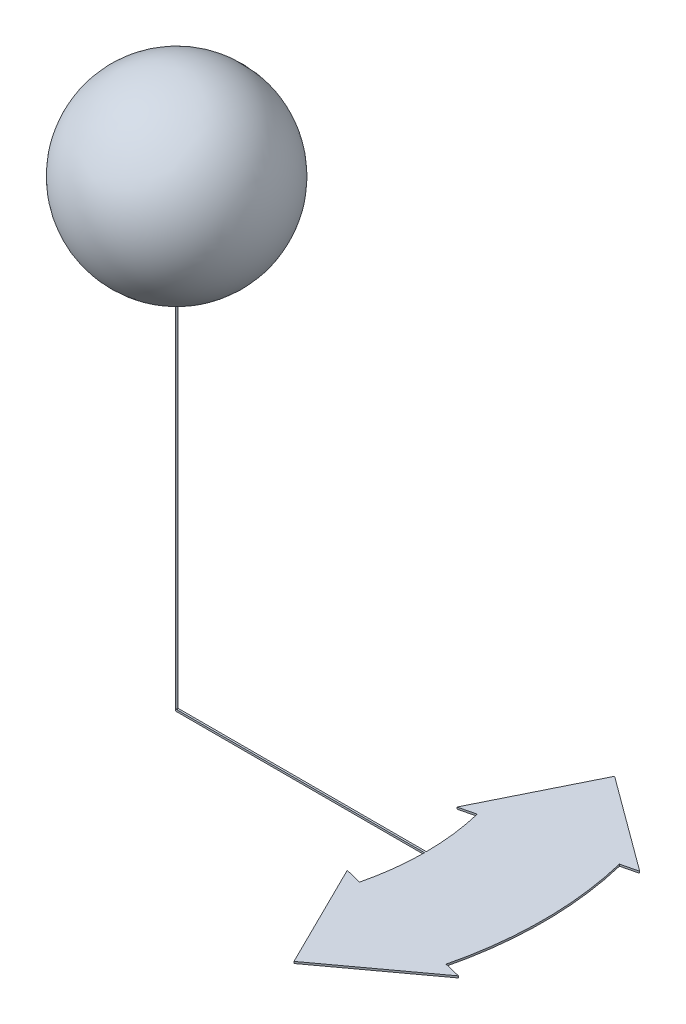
ISO-10303-21;
HEADER;
FILE_DESCRIPTION(('STEP AP214'),'2;1');
FILE_NAME('part.step','',(''),(''),'','','');
FILE_SCHEMA(('AUTOMOTIVE_DESIGN { 1 0 10303 214 1 1 1 1 }'));
ENDSEC;
DATA;
#1=APPLICATION_CONTEXT('core data for automotive mechanical design processes');
#2=APPLICATION_PROTOCOL_DEFINITION('international standard','automotive_design',2000,#1);
#3=PRODUCT_CONTEXT('',#1,'mechanical');
#4=PRODUCT('Part','Part','',(#3));
#5=PRODUCT_RELATED_PRODUCT_CATEGORY('part','',(#4));
#6=PRODUCT_DEFINITION_FORMATION('','',#4);
#7=PRODUCT_DEFINITION_CONTEXT('part definition',#1,'design');
#8=PRODUCT_DEFINITION('design','',#6,#7);
#9=PRODUCT_DEFINITION_SHAPE('','',#8);
#10=(LENGTH_UNIT() NAMED_UNIT(*) SI_UNIT(.MILLI.,.METRE.));
#11=(NAMED_UNIT(*) PLANE_ANGLE_UNIT() SI_UNIT($,.RADIAN.));
#12=(NAMED_UNIT(*) SI_UNIT($,.STERADIAN.) SOLID_ANGLE_UNIT());
#13=UNCERTAINTY_MEASURE_WITH_UNIT(LENGTH_MEASURE(1.E-05),#10,'distance_accuracy_value','');
#14=(GEOMETRIC_REPRESENTATION_CONTEXT(3) GLOBAL_UNCERTAINTY_ASSIGNED_CONTEXT((#13)) GLOBAL_UNIT_ASSIGNED_CONTEXT((#10,
#11,#12)) REPRESENTATION_CONTEXT('',''));
#15=CARTESIAN_POINT('',(0.,0.,0.));
#16=DIRECTION('',(0.,0.,1.));
#17=DIRECTION('',(1.,0.,0.));
#18=AXIS2_PLACEMENT_3D('',#15,#16,#17);
#19=CARTESIAN_POINT('',(0.,0.,0.));
#20=DIRECTION('',(1.,0.,0.));
#21=DIRECTION('',(0.,-1.,0.));
#22=AXIS2_PLACEMENT_3D('',#19,#20,#21);
#23=SPHERICAL_SURFACE('',#22,5.);
#24=CARTESIAN_POINT('',(0.,-4.00000000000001,0.));
#25=DIRECTION('',(0.,1.,0.));
#26=DIRECTION('',(0.,0.,1.));
#27=AXIS2_PLACEMENT_3D('',#24,#25,#26);
#28=CIRCLE('',#27,3.);
#29=CARTESIAN_POINT('',(0.,-4.00000000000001,3.00000000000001));
#30=VERTEX_POINT('',#29);
#31=EDGE_CURVE('E263',#30,#30,#28,.T.);
#32=ORIENTED_EDGE('',*,*,#31,.T.);
#33=EDGE_LOOP('',(#32));
#34=FACE_BOUND('',#33,.T.);
#35=CARTESIAN_POINT('',(0.,0.,-4.));
#36=DIRECTION('',(0.,0.,1.));
#37=DIRECTION('',(1.,0.,0.));
#38=AXIS2_PLACEMENT_3D('',#35,#36,#37);
#39=CIRCLE('',#38,3.);
#40=CARTESIAN_POINT('',(3.00000000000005,0.,-4.));
#41=VERTEX_POINT('',#40);
#42=EDGE_CURVE('E269',#41,#41,#39,.T.);
#43=ORIENTED_EDGE('',*,*,#42,.T.);
#44=EDGE_LOOP('',(#43));
#45=FACE_BOUND('',#44,.T.);
#46=ADVANCED_FACE('F32',(#34,#45),#23,.T.);
#47=CARTESIAN_POINT('',(0.,0.,-5.));
#48=DIRECTION('',(0.,0.,1.));
#49=DIRECTION('',(1.,0.,0.));
#50=AXIS2_PLACEMENT_3D('',#47,#48,#49);
#51=CYLINDRICAL_SURFACE('',#50,3.);
#52=CARTESIAN_POINT('',(0.,0.,0.));
#53=DIRECTION('',(0.,0.,1.));
#54=DIRECTION('',(1.,0.,0.));
#55=AXIS2_PLACEMENT_3D('',#52,#53,#54);
#56=CIRCLE('',#55,3.);
#57=CARTESIAN_POINT('',(3.00000000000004,0.,0.));
#58=VERTEX_POINT('',#57);
#59=CARTESIAN_POINT('',(-2.99999999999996,0.,0.));
#60=VERTEX_POINT('',#59);
#61=EDGE_CURVE('E266',#58,#60,#56,.T.);
#62=ORIENTED_EDGE('',*,*,#61,.T.);
#63=CARTESIAN_POINT('',(0.,0.,0.));
#64=DIRECTION('',(0.,-0.707106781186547,0.70710678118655));
#65=DIRECTION('',(0.,0.707106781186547,0.70710678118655));
#66=AXIS2_PLACEMENT_3D('',#63,#64,#65);
#67=ELLIPSE('',#66,4.24264068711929,3.);
#68=EDGE_CURVE('E260',#60,#58,#67,.T.);
#69=ORIENTED_EDGE('',*,*,#68,.T.);
#70=EDGE_LOOP('',(#62,#69));
#71=FACE_BOUND('',#70,.T.);
#72=ORIENTED_EDGE('',*,*,#42,.F.);
#73=EDGE_LOOP('',(#72));
#74=FACE_BOUND('',#73,.T.);
#75=ADVANCED_FACE('F287',(#71,#74),#51,.F.);
#76=CARTESIAN_POINT('',(0.,0.,0.));
#77=DIRECTION('',(0.,0.,1.));
#78=DIRECTION('',(1.,0.,0.));
#79=AXIS2_PLACEMENT_3D('',#76,#77,#78);
#80=PLANE('',#79);
#81=ORIENTED_EDGE('',*,*,#61,.F.);
#82=DIRECTION('',(-1.,0.,0.));
#83=VECTOR('',#82,1.);
#84=CARTESIAN_POINT('',(0.,0.,0.));
#85=LINE('',#84,#83);
#86=CARTESIAN_POINT('',(0.0499999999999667,0.,0.));
#87=VERTEX_POINT('',#86);
#88=EDGE_CURVE('E39',#58,#87,#85,.T.);
#89=ORIENTED_EDGE('',*,*,#88,.T.);
#90=CARTESIAN_POINT('',(-0.05000000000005,0.,0.));
#91=VERTEX_POINT('',#90);
#92=EDGE_CURVE('E273',#87,#91,#85,.T.);
#93=ORIENTED_EDGE('',*,*,#92,.T.);
#94=EDGE_CURVE('E271',#91,#60,#85,.T.);
#95=ORIENTED_EDGE('',*,*,#94,.T.);
#96=EDGE_LOOP('',(#81,#89,#93,#95));
#97=FACE_BOUND('',#96,.T.);
#98=ADVANCED_FACE('F279',(#97),#80,.F.);
#99=CARTESIAN_POINT('',(0.,-5.,0.));
#100=DIRECTION('',(0.,1.,0.));
#101=DIRECTION('',(0.,0.,1.));
#102=AXIS2_PLACEMENT_3D('',#99,#100,#101);
#103=CYLINDRICAL_SURFACE('',#102,3.);
#104=CARTESIAN_POINT('',(0.,0.,0.));
#105=DIRECTION('',(0.,1.,0.));
#106=DIRECTION('',(0.,0.,1.));
#107=AXIS2_PLACEMENT_3D('',#104,#105,#106);
#108=CIRCLE('',#107,3.);
#109=EDGE_CURVE('E257',#60,#58,#108,.T.);
#110=ORIENTED_EDGE('',*,*,#109,.T.);
#111=ORIENTED_EDGE('',*,*,#68,.F.);
#112=EDGE_LOOP('',(#110,#111));
#113=FACE_BOUND('',#112,.T.);
#114=ORIENTED_EDGE('',*,*,#31,.F.);
#115=EDGE_LOOP('',(#114));
#116=FACE_BOUND('',#115,.T.);
#117=ADVANCED_FACE('F284',(#113,#116),#103,.F.);
#118=CARTESIAN_POINT('',(0.,0.,0.));
#119=DIRECTION('',(0.,1.,0.));
#120=DIRECTION('',(0.,0.,1.));
#121=AXIS2_PLACEMENT_3D('',#118,#119,#120);
#122=PLANE('',#121);
#123=ORIENTED_EDGE('',*,*,#94,.F.);
#124=CARTESIAN_POINT('',(0.,0.,0.));
#125=DIRECTION('',(0.,1.,0.));
#126=DIRECTION('',(0.,0.,1.));
#127=AXIS2_PLACEMENT_3D('',#124,#125,#126);
#128=CIRCLE('',#127,0.05);
#129=EDGE_CURVE('E11',#91,#87,#128,.T.);
#130=ORIENTED_EDGE('',*,*,#129,.T.);
#131=ORIENTED_EDGE('',*,*,#88,.F.);
#132=ORIENTED_EDGE('',*,*,#109,.F.);
#133=EDGE_LOOP('',(#123,#130,#131,#132));
#134=FACE_BOUND('',#133,.T.);
#135=ADVANCED_FACE('F282',(#134),#122,.F.);
#136=CARTESIAN_POINT('',(0.,0.,0.));
#137=DIRECTION('',(0.,1.,0.));
#138=DIRECTION('',(0.,0.,1.));
#139=AXIS2_PLACEMENT_3D('',#136,#137,#138);
#140=PLANE('',#139);
#141=ORIENTED_EDGE('',*,*,#92,.F.);
#142=CARTESIAN_POINT('',(0.,0.,0.));
#143=DIRECTION('',(0.,1.,0.));
#144=DIRECTION('',(0.,0.,1.));
#145=AXIS2_PLACEMENT_3D('',#142,#143,#144);
#146=CIRCLE('',#145,0.05);
#147=EDGE_CURVE('E53',#87,#91,#146,.T.);
#148=ORIENTED_EDGE('',*,*,#147,.T.);
#149=EDGE_LOOP('',(#141,#148));
#150=FACE_BOUND('',#149,.T.);
#151=ADVANCED_FACE('F303',(#150),#140,.T.);
#152=CARTESIAN_POINT('',(0.,-25.,0.));
#153=DIRECTION('',(0.,1.,0.));
#154=DIRECTION('',(0.,0.,1.));
#155=AXIS2_PLACEMENT_3D('',#152,#153,#154);
#156=CYLINDRICAL_SURFACE('',#155,0.05);
#157=CARTESIAN_POINT('',(0.,-25.,0.));
#158=DIRECTION('',(0.,1.,0.));
#159=DIRECTION('',(0.,0.,1.));
#160=AXIS2_PLACEMENT_3D('',#157,#158,#159);
#161=CIRCLE('',#160,0.05);
#162=CARTESIAN_POINT('',(0.,-25.,0.0500000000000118));
#163=VERTEX_POINT('',#162);
#164=CARTESIAN_POINT('',(0.,-25.0000000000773,-0.0499999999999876));
#165=VERTEX_POINT('',#164);
#166=EDGE_CURVE('E255',#163,#165,#161,.T.);
#167=ORIENTED_EDGE('',*,*,#166,.T.);
#168=DIRECTION('',(0.,1.,0.));
#169=VECTOR('',#168,1.);
#170=CARTESIAN_POINT('',(0.,-25.1000000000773,-0.049999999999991));
#171=LINE('',#170,#169);
#172=CARTESIAN_POINT('',(0.,-25.1000000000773,-0.049999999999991));
#173=VERTEX_POINT('',#172);
#174=EDGE_CURVE('E247',#173,#165,#171,.T.);
#175=ORIENTED_EDGE('',*,*,#174,.F.);
#176=CARTESIAN_POINT('',(0.,-25.1000000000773,0.));
#177=DIRECTION('',(0.,-1.,0.));
#178=DIRECTION('',(0.,0.,-1.));
#179=AXIS2_PLACEMENT_3D('',#176,#177,#178);
#180=CIRCLE('',#179,0.0499999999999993);
#181=CARTESIAN_POINT('',(0.,-25.1000000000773,0.0500000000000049));
#182=VERTEX_POINT('',#181);
#183=EDGE_CURVE('E202',#182,#173,#180,.T.);
#184=ORIENTED_EDGE('',*,*,#183,.F.);
#185=DIRECTION('',(0.,1.,0.));
#186=VECTOR('',#185,1.);
#187=CARTESIAN_POINT('',(0.,-25.1000000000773,0.0500000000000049));
#188=LINE('',#187,#186);
#189=EDGE_CURVE('E46',#182,#163,#188,.T.);
#190=ORIENTED_EDGE('',*,*,#189,.T.);
#191=EDGE_LOOP('',(#167,#175,#184,#190));
#192=FACE_BOUND('',#191,.T.);
#193=ORIENTED_EDGE('',*,*,#147,.F.);
#194=ORIENTED_EDGE('',*,*,#129,.F.);
#195=EDGE_LOOP('',(#193,#194));
#196=FACE_BOUND('',#195,.T.);
#197=ADVANCED_FACE('F307',(#192,#196),#156,.T.);
#198=CARTESIAN_POINT('',(12.2318840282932,-25.1000000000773,2.97580678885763));
#199=DIRECTION('',(0.896280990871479,0.,-0.443486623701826));
#200=DIRECTION('',(-0.443486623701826,0.,-0.89628099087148));
#201=AXIS2_PLACEMENT_3D('',#198,#199,#200);
#202=PLANE('',#201);
#203=DIRECTION('',(-0.443486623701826,0.,-0.89628099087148));
#204=VECTOR('',#203,1.);
#205=CARTESIAN_POINT('',(12.2318840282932,-25.0000000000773,2.97580678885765));
#206=LINE('',#205,#204);
#207=CARTESIAN_POINT('',(15.062424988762,-25.0000000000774,8.69629512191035));
#208=VERTEX_POINT('',#207);
#209=CARTESIAN_POINT('',(12.2318840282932,-25.0000000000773,2.97580678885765));
#210=VERTEX_POINT('',#209);
#211=EDGE_CURVE('E152',#208,#210,#206,.T.);
#212=ORIENTED_EDGE('',*,*,#211,.T.);
#213=DIRECTION('',(0.,1.,0.));
#214=VECTOR('',#213,1.);
#215=CARTESIAN_POINT('',(12.2318840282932,-25.1000000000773,2.97580678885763));
#216=LINE('',#215,#214);
#217=CARTESIAN_POINT('',(12.2318840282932,-25.1000000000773,2.97580678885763));
#218=VERTEX_POINT('',#217);
#219=EDGE_CURVE('E160',#218,#210,#216,.T.);
#220=ORIENTED_EDGE('',*,*,#219,.F.);
#221=DIRECTION('',(-0.443486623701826,0.,-0.89628099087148));
#222=VECTOR('',#221,1.);
#223=CARTESIAN_POINT('',(12.2318840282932,-25.1000000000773,2.97580678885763));
#224=LINE('',#223,#222);
#225=CARTESIAN_POINT('',(15.062424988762,-25.1000000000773,8.69629512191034));
#226=VERTEX_POINT('',#225);
#227=EDGE_CURVE('E195',#226,#218,#224,.T.);
#228=ORIENTED_EDGE('',*,*,#227,.F.);
#229=DIRECTION('',(0.,1.,0.));
#230=VECTOR('',#229,1.);
#231=CARTESIAN_POINT('',(15.062424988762,-25.1000000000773,8.69629512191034));
#232=LINE('',#231,#230);
#233=EDGE_CURVE('E171',#226,#208,#232,.T.);
#234=ORIENTED_EDGE('',*,*,#233,.T.);
#235=EDGE_LOOP('',(#212,#220,#228,#234));
#236=FACE_BOUND('',#235,.T.);
#237=ADVANCED_FACE('F169',(#236),#202,.F.);
#238=CARTESIAN_POINT('',(13.1173935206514,-25.1000000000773,3.1912360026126));
#239=DIRECTION('',(-0.236387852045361,0.,0.971658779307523));
#240=DIRECTION('',(0.971658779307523,0.,0.236387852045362));
#241=AXIS2_PLACEMENT_3D('',#238,#239,#240);
#242=PLANE('',#241);
#243=DIRECTION('',(0.971658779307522,0.,0.236387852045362));
#244=VECTOR('',#243,1.);
#245=CARTESIAN_POINT('',(13.1173935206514,-25.0000000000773,3.19123600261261));
#246=LINE('',#245,#244);
#247=CARTESIAN_POINT('',(13.1173935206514,-25.0000000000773,3.19123600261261));
#248=VERTEX_POINT('',#247);
#249=EDGE_CURVE('E146',#210,#248,#246,.T.);
#250=ORIENTED_EDGE('',*,*,#249,.T.);
#251=DIRECTION('',(0.,1.,0.));
#252=VECTOR('',#251,1.);
#253=CARTESIAN_POINT('',(13.1173935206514,-25.1000000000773,3.1912360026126));
#254=LINE('',#253,#252);
#255=CARTESIAN_POINT('',(13.1173935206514,-25.1000000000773,3.1912360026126));
#256=VERTEX_POINT('',#255);
#257=EDGE_CURVE('E166',#256,#248,#254,.T.);
#258=ORIENTED_EDGE('',*,*,#257,.F.);
#259=DIRECTION('',(0.971658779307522,0.,0.236387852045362));
#260=VECTOR('',#259,1.);
#261=CARTESIAN_POINT('',(13.1173935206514,-25.1000000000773,3.1912360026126));
#262=LINE('',#261,#260);
#263=EDGE_CURVE('E162',#218,#256,#262,.T.);
#264=ORIENTED_EDGE('',*,*,#263,.F.);
#265=ORIENTED_EDGE('',*,*,#219,.T.);
#266=EDGE_LOOP('',(#250,#258,#264,#265));
#267=FACE_BOUND('',#266,.T.);
#268=ADVANCED_FACE('F161',(#267),#242,.F.);
#269=CARTESIAN_POINT('',(0.,-25.1000000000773,0.));
#270=DIRECTION('',(0.,1.,0.));
#271=DIRECTION('',(0.,0.,1.));
#272=AXIS2_PLACEMENT_3D('',#269,#270,#271);
#273=CYLINDRICAL_SURFACE('',#272,13.5);
#274=CARTESIAN_POINT('',(0.,-25.0000000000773,0.));
#275=DIRECTION('',(0.,1.,0.));
#276=DIRECTION('',(0.,0.,-1.));
#277=AXIS2_PLACEMENT_3D('',#274,#275,#276);
#278=CIRCLE('',#277,13.5);
#279=CARTESIAN_POINT('',(13.4999074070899,-25.0000000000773,0.0500000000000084));
#280=VERTEX_POINT('',#279);
#281=EDGE_CURVE('E154',#248,#280,#278,.T.);
#282=ORIENTED_EDGE('',*,*,#281,.T.);
#283=DIRECTION('',(0.,1.,0.));
#284=VECTOR('',#283,1.);
#285=CARTESIAN_POINT('',(13.4999074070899,-25.1000000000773,0.0500000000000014));
#286=LINE('',#285,#284);
#287=CARTESIAN_POINT('',(13.4999074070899,-25.1000000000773,0.0500000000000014));
#288=VERTEX_POINT('',#287);
#289=EDGE_CURVE('E250',#288,#280,#286,.T.);
#290=ORIENTED_EDGE('',*,*,#289,.F.);
#291=CARTESIAN_POINT('',(0.,-25.1000000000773,0.));
#292=DIRECTION('',(0.,1.,0.));
#293=DIRECTION('',(0.,0.,-1.));
#294=AXIS2_PLACEMENT_3D('',#291,#292,#293);
#295=CIRCLE('',#294,13.5);
#296=EDGE_CURVE('E198',#256,#288,#295,.T.);
#297=ORIENTED_EDGE('',*,*,#296,.F.);
#298=ORIENTED_EDGE('',*,*,#257,.T.);
#299=EDGE_LOOP('',(#282,#290,#297,#298));
#300=FACE_BOUND('',#299,.T.);
#301=ADVANCED_FACE('F317',(#300),#273,.F.);
#302=CARTESIAN_POINT('',(0.,-25.1000000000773,0.0500000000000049));
#303=DIRECTION('',(0.,0.,-1.));
#304=DIRECTION('',(-1.,0.,0.));
#305=AXIS2_PLACEMENT_3D('',#302,#303,#304);
#306=PLANE('',#305);
#307=DIRECTION('',(-1.,0.,0.));
#308=VECTOR('',#307,1.);
#309=CARTESIAN_POINT('',(0.,-25.0000000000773,0.0500000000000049));
#310=LINE('',#309,#308);
#311=EDGE_CURVE('E175',#280,#163,#310,.T.);
#312=ORIENTED_EDGE('',*,*,#311,.T.);
#313=ORIENTED_EDGE('',*,*,#189,.F.);
#314=DIRECTION('',(-1.,0.,0.));
#315=VECTOR('',#314,1.);
#316=CARTESIAN_POINT('',(0.,-25.1000000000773,0.0500000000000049));
#317=LINE('',#316,#315);
#318=EDGE_CURVE('E200',#288,#182,#317,.T.);
#319=ORIENTED_EDGE('',*,*,#318,.F.);
#320=ORIENTED_EDGE('',*,*,#289,.T.);
#321=EDGE_LOOP('',(#312,#313,#319,#320));
#322=FACE_BOUND('',#321,.T.);
#323=ADVANCED_FACE('F320',(#322),#306,.F.);
#324=CARTESIAN_POINT('',(0.,-25.1000000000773,-0.049999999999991));
#325=DIRECTION('',(0.,0.,1.));
#326=DIRECTION('',(1.,0.,0.));
#327=AXIS2_PLACEMENT_3D('',#324,#325,#326);
#328=PLANE('',#327);
#329=DIRECTION('',(1.,0.,0.));
#330=VECTOR('',#329,1.);
#331=CARTESIAN_POINT('',(0.,-25.0000000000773,-0.0499999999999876));
#332=LINE('',#331,#330);
#333=CARTESIAN_POINT('',(13.4999074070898,-25.0000000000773,-0.0499999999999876));
#334=VERTEX_POINT('',#333);
#335=EDGE_CURVE('E177',#165,#334,#332,.T.);
#336=ORIENTED_EDGE('',*,*,#335,.T.);
#337=DIRECTION('',(0.,1.,0.));
#338=VECTOR('',#337,1.);
#339=CARTESIAN_POINT('',(13.4999074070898,-25.1000000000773,-0.0499999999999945));
#340=LINE('',#339,#338);
#341=CARTESIAN_POINT('',(13.4999074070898,-25.1000000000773,-0.0499999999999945));
#342=VERTEX_POINT('',#341);
#343=EDGE_CURVE('E244',#342,#334,#340,.T.);
#344=ORIENTED_EDGE('',*,*,#343,.F.);
#345=DIRECTION('',(1.,0.,0.));
#346=VECTOR('',#345,1.);
#347=CARTESIAN_POINT('',(0.,-25.1000000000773,-0.049999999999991));
#348=LINE('',#347,#346);
#349=EDGE_CURVE('E204',#173,#342,#348,.T.);
#350=ORIENTED_EDGE('',*,*,#349,.F.);
#351=ORIENTED_EDGE('',*,*,#174,.T.);
#352=EDGE_LOOP('',(#336,#344,#350,#351));
#353=FACE_BOUND('',#352,.T.);
#354=ADVANCED_FACE('F324',(#353),#328,.F.);
#355=CARTESIAN_POINT('',(0.,-25.1000000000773,0.));
#356=DIRECTION('',(0.,1.,0.));
#357=DIRECTION('',(0.,0.,1.));
#358=AXIS2_PLACEMENT_3D('',#355,#356,#357);
#359=CYLINDRICAL_SURFACE('',#358,13.5);
#360=CARTESIAN_POINT('',(0.,-25.0000000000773,0.));
#361=DIRECTION('',(0.,1.,0.));
#362=DIRECTION('',(0.,0.,-1.));
#363=AXIS2_PLACEMENT_3D('',#360,#361,#362);
#364=CIRCLE('',#363,13.5);
#365=CARTESIAN_POINT('',(13.1173935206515,-25.0000000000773,-3.19123600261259));
#366=VERTEX_POINT('',#365);
#367=EDGE_CURVE('E179',#334,#366,#364,.T.);
#368=ORIENTED_EDGE('',*,*,#367,.T.);
#369=DIRECTION('',(0.,1.,0.));
#370=VECTOR('',#369,1.);
#371=CARTESIAN_POINT('',(13.1173935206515,-25.1000000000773,-3.1912360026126));
#372=LINE('',#371,#370);
#373=CARTESIAN_POINT('',(13.1173935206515,-25.1000000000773,-3.1912360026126));
#374=VERTEX_POINT('',#373);
#375=EDGE_CURVE('E241',#374,#366,#372,.T.);
#376=ORIENTED_EDGE('',*,*,#375,.F.);
#377=CARTESIAN_POINT('',(0.,-25.1000000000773,0.));
#378=DIRECTION('',(0.,1.,0.));
#379=DIRECTION('',(0.,0.,-1.));
#380=AXIS2_PLACEMENT_3D('',#377,#378,#379);
#381=CIRCLE('',#380,13.5);
#382=EDGE_CURVE('E206',#342,#374,#381,.T.);
#383=ORIENTED_EDGE('',*,*,#382,.F.);
#384=ORIENTED_EDGE('',*,*,#343,.T.);
#385=EDGE_LOOP('',(#368,#376,#383,#384));
#386=FACE_BOUND('',#385,.T.);
#387=ADVANCED_FACE('F328',(#386),#359,.F.);
#388=CARTESIAN_POINT('',(13.1173935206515,-25.1000000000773,-3.1912360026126));
#389=DIRECTION('',(-0.236387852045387,0.,-0.971658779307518));
#390=DIRECTION('',(-0.971658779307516,0.,0.236387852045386));
#391=AXIS2_PLACEMENT_3D('',#388,#389,#390);
#392=PLANE('',#391);
#393=DIRECTION('',(-0.971658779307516,0.,0.236387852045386));
#394=VECTOR('',#393,1.);
#395=CARTESIAN_POINT('',(13.1173935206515,-25.0000000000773,-3.19123600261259));
#396=LINE('',#395,#394);
#397=CARTESIAN_POINT('',(12.2318840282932,-25.0000000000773,-2.97580678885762));
#398=VERTEX_POINT('',#397);
#399=EDGE_CURVE('E181',#366,#398,#396,.T.);
#400=ORIENTED_EDGE('',*,*,#399,.T.);
#401=DIRECTION('',(0.,1.,0.));
#402=VECTOR('',#401,1.);
#403=CARTESIAN_POINT('',(12.2318840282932,-25.1000000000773,-2.97580678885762));
#404=LINE('',#403,#402);
#405=CARTESIAN_POINT('',(12.2318840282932,-25.1000000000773,-2.97580678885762));
#406=VERTEX_POINT('',#405);
#407=EDGE_CURVE('E238',#406,#398,#404,.T.);
#408=ORIENTED_EDGE('',*,*,#407,.F.);
#409=DIRECTION('',(-0.971658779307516,0.,0.236387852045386));
#410=VECTOR('',#409,1.);
#411=CARTESIAN_POINT('',(13.1173935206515,-25.1000000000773,-3.1912360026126));
#412=LINE('',#411,#410);
#413=EDGE_CURVE('E208',#374,#406,#412,.T.);
#414=ORIENTED_EDGE('',*,*,#413,.F.);
#415=ORIENTED_EDGE('',*,*,#375,.T.);
#416=EDGE_LOOP('',(#400,#408,#414,#415));
#417=FACE_BOUND('',#416,.T.);
#418=ADVANCED_FACE('F332',(#417),#392,.F.);
#419=CARTESIAN_POINT('',(12.2318840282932,-25.1000000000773,-2.97580678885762));
#420=DIRECTION('',(0.896280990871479,0.,0.443486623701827));
#421=DIRECTION('',(0.443486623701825,0.,-0.89628099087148));
#422=AXIS2_PLACEMENT_3D('',#419,#420,#421);
#423=PLANE('',#422);
#424=DIRECTION('',(0.443486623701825,0.,-0.896280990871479));
#425=VECTOR('',#424,1.);
#426=CARTESIAN_POINT('',(12.2318840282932,-25.0000000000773,-2.97580678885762));
#427=LINE('',#426,#425);
#428=CARTESIAN_POINT('',(15.062424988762,-25.0000000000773,-8.69629512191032));
#429=VERTEX_POINT('',#428);
#430=EDGE_CURVE('E183',#398,#429,#427,.T.);
#431=ORIENTED_EDGE('',*,*,#430,.T.);
#432=DIRECTION('',(0.,1.,0.));
#433=VECTOR('',#432,1.);
#434=CARTESIAN_POINT('',(15.062424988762,-25.1000000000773,-8.69629512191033));
#435=LINE('',#434,#433);
#436=CARTESIAN_POINT('',(15.062424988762,-25.1000000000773,-8.69629512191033));
#437=VERTEX_POINT('',#436);
#438=EDGE_CURVE('E235',#437,#429,#435,.T.);
#439=ORIENTED_EDGE('',*,*,#438,.F.);
#440=DIRECTION('',(0.443486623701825,0.,-0.896280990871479));
#441=VECTOR('',#440,1.);
#442=CARTESIAN_POINT('',(12.2318840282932,-25.1000000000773,-2.97580678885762));
#443=LINE('',#442,#441);
#444=EDGE_CURVE('E210',#406,#437,#443,.T.);
#445=ORIENTED_EDGE('',*,*,#444,.F.);
#446=ORIENTED_EDGE('',*,*,#407,.T.);
#447=EDGE_LOOP('',(#431,#439,#445,#446));
#448=FACE_BOUND('',#447,.T.);
#449=ADVANCED_FACE('F336',(#448),#423,.F.);
#450=CARTESIAN_POINT('',(15.062424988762,-25.1000000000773,-8.69629512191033));
#451=DIRECTION('',(-0.592386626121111,0.,0.805653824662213));
#452=DIRECTION('',(0.805653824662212,0.,0.592386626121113));
#453=AXIS2_PLACEMENT_3D('',#450,#451,#452);
#454=PLANE('',#453);
#455=DIRECTION('',(0.805653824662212,0.,0.592386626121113));
#456=VECTOR('',#455,1.);
#457=CARTESIAN_POINT('',(15.062424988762,-25.0000000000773,-8.69629512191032));
#458=LINE('',#457,#456);
#459=CARTESIAN_POINT('',(20.2044879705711,-25.0000000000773,-4.91540406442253));
#460=VERTEX_POINT('',#459);
#461=EDGE_CURVE('E185',#429,#460,#458,.T.);
#462=ORIENTED_EDGE('',*,*,#461,.T.);
#463=DIRECTION('',(0.,1.,0.));
#464=VECTOR('',#463,1.);
#465=CARTESIAN_POINT('',(20.2044879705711,-25.1000000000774,-4.91540406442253));
#466=LINE('',#465,#464);
#467=CARTESIAN_POINT('',(20.2044879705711,-25.1000000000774,-4.91540406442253));
#468=VERTEX_POINT('',#467);
#469=EDGE_CURVE('E232',#468,#460,#466,.T.);
#470=ORIENTED_EDGE('',*,*,#469,.F.);
#471=DIRECTION('',(0.805653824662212,0.,0.592386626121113));
#472=VECTOR('',#471,1.);
#473=CARTESIAN_POINT('',(15.062424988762,-25.1000000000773,-8.69629512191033));
#474=LINE('',#473,#472);
#475=EDGE_CURVE('E212',#437,#468,#474,.T.);
#476=ORIENTED_EDGE('',*,*,#475,.F.);
#477=ORIENTED_EDGE('',*,*,#438,.T.);
#478=EDGE_LOOP('',(#462,#470,#476,#477));
#479=FACE_BOUND('',#478,.T.);
#480=ADVANCED_FACE('F340',(#479),#454,.F.);
#481=CARTESIAN_POINT('',(19.318978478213,-25.1000000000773,-4.69997485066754));
#482=DIRECTION('',(-0.236387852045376,0.,-0.97165877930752));
#483=DIRECTION('',(-0.971658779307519,0.,0.236387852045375));
#484=AXIS2_PLACEMENT_3D('',#481,#482,#483);
#485=PLANE('',#484);
#486=DIRECTION('',(-0.971658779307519,0.,0.236387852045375));
#487=VECTOR('',#486,1.);
#488=CARTESIAN_POINT('',(19.318978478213,-25.0000000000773,-4.69997485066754));
#489=LINE('',#488,#487);
#490=CARTESIAN_POINT('',(19.318978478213,-25.0000000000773,-4.69997485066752));
#491=VERTEX_POINT('',#490);
#492=EDGE_CURVE('E187',#460,#491,#489,.T.);
#493=ORIENTED_EDGE('',*,*,#492,.T.);
#494=DIRECTION('',(0.,1.,0.));
#495=VECTOR('',#494,1.);
#496=CARTESIAN_POINT('',(19.318978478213,-25.1000000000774,-4.69997485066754));
#497=LINE('',#496,#495);
#498=CARTESIAN_POINT('',(19.318978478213,-25.1000000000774,-4.69997485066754));
#499=VERTEX_POINT('',#498);
#500=EDGE_CURVE('E229',#499,#491,#497,.T.);
#501=ORIENTED_EDGE('',*,*,#500,.F.);
#502=DIRECTION('',(-0.971658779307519,0.,0.236387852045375));
#503=VECTOR('',#502,1.);
#504=CARTESIAN_POINT('',(19.318978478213,-25.1000000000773,-4.69997485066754));
#505=LINE('',#504,#503);
#506=EDGE_CURVE('E214',#468,#499,#505,.T.);
#507=ORIENTED_EDGE('',*,*,#506,.F.);
#508=ORIENTED_EDGE('',*,*,#469,.T.);
#509=EDGE_LOOP('',(#493,#501,#507,#508));
#510=FACE_BOUND('',#509,.T.);
#511=ADVANCED_FACE('F344',(#510),#485,.F.);
#512=CARTESIAN_POINT('',(0.,-25.1000000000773,0.));
#513=DIRECTION('',(0.,1.,0.));
#514=DIRECTION('',(0.,0.,1.));
#515=AXIS2_PLACEMENT_3D('',#512,#513,#514);
#516=CYLINDRICAL_SURFACE('',#515,19.8824720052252);
#517=CARTESIAN_POINT('',(0.,-25.0000000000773,0.));
#518=DIRECTION('',(0.,-1.,0.));
#519=DIRECTION('',(0.,0.,-1.));
#520=AXIS2_PLACEMENT_3D('',#517,#518,#519);
#521=CIRCLE('',#520,19.8824720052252);
#522=CARTESIAN_POINT('',(19.318978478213,-25.0000000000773,4.69997485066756));
#523=VERTEX_POINT('',#522);
#524=EDGE_CURVE('E189',#491,#523,#521,.T.);
#525=ORIENTED_EDGE('',*,*,#524,.T.);
#526=DIRECTION('',(0.,1.,0.));
#527=VECTOR('',#526,1.);
#528=CARTESIAN_POINT('',(19.318978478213,-25.1000000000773,4.69997485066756));
#529=LINE('',#528,#527);
#530=CARTESIAN_POINT('',(19.318978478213,-25.1000000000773,4.69997485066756));
#531=VERTEX_POINT('',#530);
#532=EDGE_CURVE('E226',#531,#523,#529,.T.);
#533=ORIENTED_EDGE('',*,*,#532,.F.);
#534=CARTESIAN_POINT('',(0.,-25.1000000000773,0.));
#535=DIRECTION('',(0.,-1.,0.));
#536=DIRECTION('',(0.,0.,-1.));
#537=AXIS2_PLACEMENT_3D('',#534,#535,#536);
#538=CIRCLE('',#537,19.8824720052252);
#539=EDGE_CURVE('E216',#499,#531,#538,.T.);
#540=ORIENTED_EDGE('',*,*,#539,.F.);
#541=ORIENTED_EDGE('',*,*,#500,.T.);
#542=EDGE_LOOP('',(#525,#533,#540,#541));
#543=FACE_BOUND('',#542,.T.);
#544=ADVANCED_FACE('F348',(#543),#516,.T.);
#545=CARTESIAN_POINT('',(19.318978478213,-25.1000000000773,4.69997485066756));
#546=DIRECTION('',(-0.236387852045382,0.,0.971658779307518));
#547=DIRECTION('',(0.971658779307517,0.,0.236387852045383));
#548=AXIS2_PLACEMENT_3D('',#545,#546,#547);
#549=PLANE('',#548);
#550=DIRECTION('',(0.971658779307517,0.,0.236387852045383));
#551=VECTOR('',#550,1.);
#552=CARTESIAN_POINT('',(19.318978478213,-25.0000000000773,4.69997485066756));
#553=LINE('',#552,#551);
#554=CARTESIAN_POINT('',(20.2044879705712,-25.0000000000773,4.91540406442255));
#555=VERTEX_POINT('',#554);
#556=EDGE_CURVE('E191',#523,#555,#553,.T.);
#557=ORIENTED_EDGE('',*,*,#556,.T.);
#558=DIRECTION('',(0.,1.,0.));
#559=VECTOR('',#558,1.);
#560=CARTESIAN_POINT('',(20.2044879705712,-25.1000000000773,4.91540406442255));
#561=LINE('',#560,#559);
#562=CARTESIAN_POINT('',(20.2044879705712,-25.1000000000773,4.91540406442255));
#563=VERTEX_POINT('',#562);
#564=EDGE_CURVE('E223',#563,#555,#561,.T.);
#565=ORIENTED_EDGE('',*,*,#564,.F.);
#566=DIRECTION('',(0.971658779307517,0.,0.236387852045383));
#567=VECTOR('',#566,1.);
#568=CARTESIAN_POINT('',(19.318978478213,-25.1000000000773,4.69997485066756));
#569=LINE('',#568,#567);
#570=EDGE_CURVE('E218',#531,#563,#569,.T.);
#571=ORIENTED_EDGE('',*,*,#570,.F.);
#572=ORIENTED_EDGE('',*,*,#532,.T.);
#573=EDGE_LOOP('',(#557,#565,#571,#572));
#574=FACE_BOUND('',#573,.T.);
#575=ADVANCED_FACE('F352',(#574),#549,.F.);
#576=CARTESIAN_POINT('',(15.062424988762,-25.1000000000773,8.69629512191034));
#577=DIRECTION('',(-0.592386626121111,0.,-0.805653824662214));
#578=DIRECTION('',(-0.805653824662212,0.,0.592386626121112));
#579=AXIS2_PLACEMENT_3D('',#576,#577,#578);
#580=PLANE('',#579);
#581=DIRECTION('',(-0.805653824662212,0.,0.592386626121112));
#582=VECTOR('',#581,1.);
#583=CARTESIAN_POINT('',(15.062424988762,-25.0000000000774,8.69629512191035));
#584=LINE('',#583,#582);
#585=EDGE_CURVE('E193',#555,#208,#584,.T.);
#586=ORIENTED_EDGE('',*,*,#585,.T.);
#587=ORIENTED_EDGE('',*,*,#233,.F.);
#588=DIRECTION('',(-0.805653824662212,0.,0.592386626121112));
#589=VECTOR('',#588,1.);
#590=CARTESIAN_POINT('',(15.062424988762,-25.1000000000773,8.69629512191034));
#591=LINE('',#590,#589);
#592=EDGE_CURVE('E220',#563,#226,#591,.T.);
#593=ORIENTED_EDGE('',*,*,#592,.F.);
#594=ORIENTED_EDGE('',*,*,#564,.T.);
#595=EDGE_LOOP('',(#586,#587,#593,#594));
#596=FACE_BOUND('',#595,.T.);
#597=ADVANCED_FACE('F356',(#596),#580,.F.);
#598=CARTESIAN_POINT('',(0.,-25.1000000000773,0.));
#599=DIRECTION('',(0.,-1.,0.));
#600=DIRECTION('',(0.,0.,-1.));
#601=AXIS2_PLACEMENT_3D('',#598,#599,#600);
#602=PLANE('',#601);
#603=ORIENTED_EDGE('',*,*,#227,.T.);
#604=ORIENTED_EDGE('',*,*,#263,.T.);
#605=ORIENTED_EDGE('',*,*,#296,.T.);
#606=ORIENTED_EDGE('',*,*,#318,.T.);
#607=ORIENTED_EDGE('',*,*,#183,.T.);
#608=ORIENTED_EDGE('',*,*,#349,.T.);
#609=ORIENTED_EDGE('',*,*,#382,.T.);
#610=ORIENTED_EDGE('',*,*,#413,.T.);
#611=ORIENTED_EDGE('',*,*,#444,.T.);
#612=ORIENTED_EDGE('',*,*,#475,.T.);
#613=ORIENTED_EDGE('',*,*,#506,.T.);
#614=ORIENTED_EDGE('',*,*,#539,.T.);
#615=ORIENTED_EDGE('',*,*,#570,.T.);
#616=ORIENTED_EDGE('',*,*,#592,.T.);
#617=EDGE_LOOP('',(#603,#604,#605,#606,#607,#608,#609,#610,#611,#612,#613,#614,#615,#616));
#618=FACE_BOUND('',#617,.T.);
#619=ADVANCED_FACE('F360',(#618),#602,.T.);
#620=CARTESIAN_POINT('',(0.,-25.0000000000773,0.));
#621=DIRECTION('',(0.,-1.,0.));
#622=DIRECTION('',(0.,0.,-1.));
#623=AXIS2_PLACEMENT_3D('',#620,#621,#622);
#624=PLANE('',#623);
#625=ORIENTED_EDGE('',*,*,#166,.F.);
#626=ORIENTED_EDGE('',*,*,#311,.F.);
#627=ORIENTED_EDGE('',*,*,#281,.F.);
#628=ORIENTED_EDGE('',*,*,#249,.F.);
#629=ORIENTED_EDGE('',*,*,#211,.F.);
#630=ORIENTED_EDGE('',*,*,#585,.F.);
#631=ORIENTED_EDGE('',*,*,#556,.F.);
#632=ORIENTED_EDGE('',*,*,#524,.F.);
#633=ORIENTED_EDGE('',*,*,#492,.F.);
#634=ORIENTED_EDGE('',*,*,#461,.F.);
#635=ORIENTED_EDGE('',*,*,#430,.F.);
#636=ORIENTED_EDGE('',*,*,#399,.F.);
#637=ORIENTED_EDGE('',*,*,#367,.F.);
#638=ORIENTED_EDGE('',*,*,#335,.F.);
#639=EDGE_LOOP('',(#625,#626,#627,#628,#629,#630,#631,#632,#633,#634,#635,#636,#637,#638));
#640=FACE_BOUND('',#639,.T.);
#641=ADVANCED_FACE('F149',(#640),#624,.F.);
#642=CLOSED_SHELL('',(#46,#75,#98,#117,#135,#151,#197,#237,#268,#301,#323,#354,#387,#418,#449,
#480,#511,#544,#575,#597,#619,#641));
#643=MANIFOLD_SOLID_BREP('B2',#642);
#644=ADVANCED_BREP_SHAPE_REPRESENTATION('',(#18,#643),#14);
#645=SHAPE_DEFINITION_REPRESENTATION(#9,#644);
ENDSEC;
END-ISO-10303-21;
